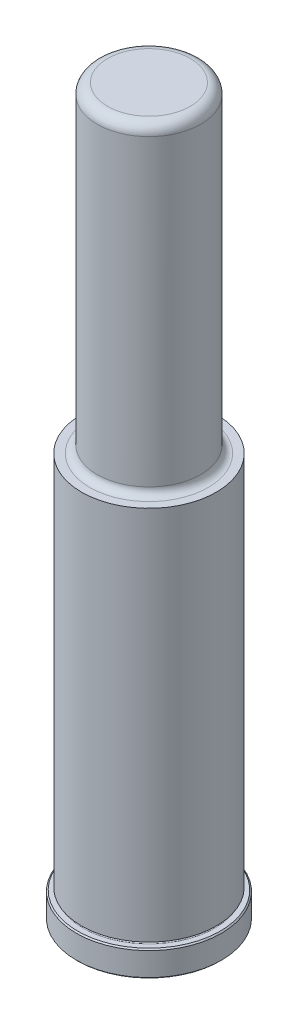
ISO-10303-21;
HEADER;
FILE_DESCRIPTION(('STEP AP214'),'2;1');
FILE_NAME('part.step','',(''),(''),'','','');
FILE_SCHEMA(('AUTOMOTIVE_DESIGN { 1 0 10303 214 1 1 1 1 }'));
ENDSEC;
DATA;
#1=APPLICATION_CONTEXT('core data for automotive mechanical design processes');
#2=APPLICATION_PROTOCOL_DEFINITION('international standard','automotive_design',2000,#1);
#3=PRODUCT_CONTEXT('',#1,'mechanical');
#4=PRODUCT('Part','Part','',(#3));
#5=PRODUCT_RELATED_PRODUCT_CATEGORY('part','',(#4));
#6=PRODUCT_DEFINITION_FORMATION('','',#4);
#7=PRODUCT_DEFINITION_CONTEXT('part definition',#1,'design');
#8=PRODUCT_DEFINITION('design','',#6,#7);
#9=PRODUCT_DEFINITION_SHAPE('','',#8);
#10=(LENGTH_UNIT() NAMED_UNIT(*) SI_UNIT(.MILLI.,.METRE.));
#11=(NAMED_UNIT(*) PLANE_ANGLE_UNIT() SI_UNIT($,.RADIAN.));
#12=(NAMED_UNIT(*) SI_UNIT($,.STERADIAN.) SOLID_ANGLE_UNIT());
#13=UNCERTAINTY_MEASURE_WITH_UNIT(LENGTH_MEASURE(1.E-05),#10,'distance_accuracy_value','');
#14=(GEOMETRIC_REPRESENTATION_CONTEXT(3) GLOBAL_UNCERTAINTY_ASSIGNED_CONTEXT((#13)) GLOBAL_UNIT_ASSIGNED_CONTEXT((#10,
#11,#12)) REPRESENTATION_CONTEXT('',''));
#15=CARTESIAN_POINT('',(0.,0.,0.));
#16=DIRECTION('',(0.,0.,1.));
#17=DIRECTION('',(1.,0.,0.));
#18=AXIS2_PLACEMENT_3D('',#15,#16,#17);
#19=CARTESIAN_POINT('',(0.,0.,0.));
#20=DIRECTION('',(0.,1.,0.));
#21=DIRECTION('',(0.,0.,1.));
#22=AXIS2_PLACEMENT_3D('',#19,#20,#21);
#23=PLANE('',#22);
#24=CARTESIAN_POINT('',(0.,0.,0.));
#25=DIRECTION('',(0.,1.,0.));
#26=DIRECTION('',(0.,0.,1.));
#27=AXIS2_PLACEMENT_3D('',#24,#25,#26);
#28=CIRCLE('',#27,21.844);
#29=CARTESIAN_POINT('',(0.,0.,21.844));
#30=VERTEX_POINT('',#29);
#31=EDGE_CURVE('E46',#30,#30,#28,.F.);
#32=ORIENTED_EDGE('',*,*,#31,.T.);
#33=EDGE_LOOP('',(#32));
#34=FACE_BOUND('',#33,.T.);
#35=ADVANCED_FACE('F31',(#34),#23,.F.);
#36=CARTESIAN_POINT('',(0.,0.,0.));
#37=DIRECTION('',(0.,1.,0.));
#38=DIRECTION('',(0.,0.,1.));
#39=AXIS2_PLACEMENT_3D('',#36,#37,#38);
#40=CYLINDRICAL_SURFACE('',#39,22.225);
#41=CARTESIAN_POINT('',(0.,0.380999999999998,0.));
#42=DIRECTION('',(0.,1.,0.));
#43=DIRECTION('',(0.,0.,1.));
#44=AXIS2_PLACEMENT_3D('',#41,#42,#43);
#45=CIRCLE('',#44,22.225);
#46=CARTESIAN_POINT('',(0.,0.380999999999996,22.225));
#47=VERTEX_POINT('',#46);
#48=EDGE_CURVE('E51',#47,#47,#45,.T.);
#49=CARTESIAN_POINT('',(0.,7.54379999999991,0.));
#50=DIRECTION('',(0.,-1.,0.));
#51=DIRECTION('',(0.,0.,-1.));
#52=AXIS2_PLACEMENT_3D('',#49,#50,#51);
#53=CIRCLE('',#52,22.225);
#54=CARTESIAN_POINT('',(0.,7.54379999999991,22.225));
#55=VERTEX_POINT('',#54);
#56=EDGE_CURVE('E54',#55,#55,#53,.T.);
#57=CARTESIAN_POINT('',(0.,0.380999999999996,22.225));
#58=CARTESIAN_POINT('',(0.,0.455612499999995,22.225));
#59=CARTESIAN_POINT('',(0.,0.530224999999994,22.225));
#60=CARTESIAN_POINT('',(0.,0.679449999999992,22.225));
#61=CARTESIAN_POINT('',(0.,0.754062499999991,22.225));
#62=CARTESIAN_POINT('',(0.,0.903287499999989,22.225));
#63=CARTESIAN_POINT('',(0.,0.977899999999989,22.225));
#64=CARTESIAN_POINT('',(0.,1.12712499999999,22.225));
#65=CARTESIAN_POINT('',(0.,1.20173749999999,22.225));
#66=CARTESIAN_POINT('',(0.,1.35096249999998,22.225));
#67=CARTESIAN_POINT('',(0.,1.42557499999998,22.225));
#68=CARTESIAN_POINT('',(0.,1.57479999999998,22.225));
#69=CARTESIAN_POINT('',(0.,1.64941249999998,22.225));
#70=CARTESIAN_POINT('',(0.,1.79863749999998,22.225));
#71=CARTESIAN_POINT('',(0.,1.87324999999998,22.225));
#72=CARTESIAN_POINT('',(0.,2.02247499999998,22.225));
#73=CARTESIAN_POINT('',(0.,2.09708749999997,22.225));
#74=CARTESIAN_POINT('',(0.,2.24631249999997,22.225));
#75=CARTESIAN_POINT('',(0.,2.32092499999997,22.225));
#76=CARTESIAN_POINT('',(0.,2.47014999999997,22.225));
#77=CARTESIAN_POINT('',(0.,2.54476249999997,22.225));
#78=CARTESIAN_POINT('',(0.,2.69398749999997,22.225));
#79=CARTESIAN_POINT('',(0.,2.76859999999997,22.225));
#80=CARTESIAN_POINT('',(0.,2.91782499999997,22.225));
#81=CARTESIAN_POINT('',(0.,2.99243749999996,22.225));
#82=CARTESIAN_POINT('',(0.,3.14166249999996,22.225));
#83=CARTESIAN_POINT('',(0.,3.21627499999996,22.225));
#84=CARTESIAN_POINT('',(0.,3.36549999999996,22.225));
#85=CARTESIAN_POINT('',(0.,3.44011249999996,22.225));
#86=CARTESIAN_POINT('',(0.,3.58933749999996,22.225));
#87=CARTESIAN_POINT('',(0.,3.66394999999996,22.225));
#88=CARTESIAN_POINT('',(0.,3.81317499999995,22.225));
#89=CARTESIAN_POINT('',(0.,3.88778749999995,22.225));
#90=CARTESIAN_POINT('',(0.,4.03701249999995,22.225));
#91=CARTESIAN_POINT('',(0.,4.11162499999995,22.225));
#92=CARTESIAN_POINT('',(0.,4.26084999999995,22.225));
#93=CARTESIAN_POINT('',(0.,4.33546249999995,22.225));
#94=CARTESIAN_POINT('',(0.,4.48468749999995,22.225));
#95=CARTESIAN_POINT('',(0.,4.55929999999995,22.225));
#96=CARTESIAN_POINT('',(0.,4.70852499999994,22.225));
#97=CARTESIAN_POINT('',(0.,4.78313749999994,22.225));
#98=CARTESIAN_POINT('',(0.,4.93236249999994,22.225));
#99=CARTESIAN_POINT('',(0.,5.00697499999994,22.225));
#100=CARTESIAN_POINT('',(0.,5.15619999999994,22.225));
#101=CARTESIAN_POINT('',(0.,5.23081249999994,22.225));
#102=CARTESIAN_POINT('',(0.,5.38003749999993,22.225));
#103=CARTESIAN_POINT('',(0.,5.45464999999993,22.225));
#104=CARTESIAN_POINT('',(0.,5.60387499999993,22.225));
#105=CARTESIAN_POINT('',(0.,5.67848749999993,22.225));
#106=CARTESIAN_POINT('',(0.,5.82771249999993,22.225));
#107=CARTESIAN_POINT('',(0.,5.90232499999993,22.225));
#108=CARTESIAN_POINT('',(0.,6.05154999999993,22.225));
#109=CARTESIAN_POINT('',(0.,6.12616249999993,22.225));
#110=CARTESIAN_POINT('',(0.,6.27538749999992,22.225));
#111=CARTESIAN_POINT('',(0.,6.34999999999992,22.225));
#112=CARTESIAN_POINT('',(0.,6.49922499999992,22.225));
#113=CARTESIAN_POINT('',(0.,6.57383749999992,22.225));
#114=CARTESIAN_POINT('',(0.,6.72306249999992,22.225));
#115=CARTESIAN_POINT('',(0.,6.79767499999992,22.225));
#116=CARTESIAN_POINT('',(0.,6.94689999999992,22.225));
#117=CARTESIAN_POINT('',(0.,7.02151249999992,22.225));
#118=CARTESIAN_POINT('',(0.,7.17073749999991,22.225));
#119=CARTESIAN_POINT('',(0.,7.24534999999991,22.225));
#120=CARTESIAN_POINT('',(0.,7.39457499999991,22.225));
#121=CARTESIAN_POINT('',(0.,7.46918749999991,22.225));
#122=CARTESIAN_POINT('',(0.,7.54379999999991,22.225));
#123=B_SPLINE_CURVE_WITH_KNOTS('',3,(#57,#58,#59,#60,#61,#62,#63,#64,#65,#66,#67,#68,#69,#70,
#71,#72,#73,#74,#75,#76,#77,#78,#79,#80,#81,#82,#83,#84,#85,#86,#87,#88,#89,#90,#91,#92,#93,#94,
#95,#96,#97,#98,#99,#100,#101,#102,#103,#104,#105,#106,#107,#108,#109,#110,#111,#112,#113,#114,
#115,#116,#117,#118,#119,#120,#121,#122),.UNSPECIFIED.,.F.,.F.,(4,2,2,2,2,2,2,2,2,2,2,2,2,2,2,2,
2,2,2,2,2,2,2,2,2,2,2,2,2,2,2,2,4),(0.,0.223837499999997,0.447674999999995,0.671512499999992,
0.895349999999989,1.11918749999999,1.34302499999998,1.56686249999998,1.79069999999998,
2.01453749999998,2.23837499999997,2.46221249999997,2.68604999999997,2.90988749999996,
3.13372499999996,3.35756249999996,3.58139999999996,3.80523749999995,4.02907499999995,
4.25291249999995,4.47674999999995,4.70058749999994,4.92442499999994,5.14826249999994,
5.37209999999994,5.59593749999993,5.81977499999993,6.04361249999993,6.26744999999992,
6.49128749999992,6.71512499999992,6.93896249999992,7.16279999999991),.UNSPECIFIED.);
#124=EDGE_CURVE('BSEAM110',#47,#55,#123,.T.);
#125=ORIENTED_EDGE('',*,*,#48,.T.);
#126=ORIENTED_EDGE('',*,*,#56,.T.);
#127=ORIENTED_EDGE('',*,*,#124,.T.);
#128=ORIENTED_EDGE('',*,*,#124,.F.);
#129=EDGE_LOOP('',(#125,#127,#126,#128));
#130=FACE_BOUND('',#129,.T.);
#131=ADVANCED_FACE('F110',(#130),#40,.T.);
#132=CARTESIAN_POINT('',(0.,7.9248,-22.225));
#133=DIRECTION('',(0.,-1.,0.));
#134=DIRECTION('',(0.,0.,-1.));
#135=AXIS2_PLACEMENT_3D('',#132,#133,#134);
#136=PLANE('',#135);
#137=CARTESIAN_POINT('',(0.,7.9248,0.));
#138=DIRECTION('',(0.,-1.,0.));
#139=DIRECTION('',(0.,0.,-1.));
#140=AXIS2_PLACEMENT_3D('',#137,#138,#139);
#141=CIRCLE('',#140,21.8439999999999);
#142=CARTESIAN_POINT('',(0.,7.9248,-21.8439999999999));
#143=VERTEX_POINT('',#142);
#144=EDGE_CURVE('E42',#143,#143,#141,.F.);
#145=ORIENTED_EDGE('',*,*,#144,.T.);
#146=EDGE_LOOP('',(#145));
#147=FACE_BOUND('',#146,.T.);
#148=CARTESIAN_POINT('',(0.,7.9248,0.));
#149=DIRECTION('',(0.,1.,0.));
#150=DIRECTION('',(0.,0.,1.));
#151=AXIS2_PLACEMENT_3D('',#148,#149,#150);
#152=CIRCLE('',#151,20.2438);
#153=CARTESIAN_POINT('',(0.,7.92479999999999,20.2438));
#154=VERTEX_POINT('',#153);
#155=EDGE_CURVE('E57',#154,#154,#152,.T.);
#156=ORIENTED_EDGE('',*,*,#155,.F.);
#157=EDGE_LOOP('',(#156));
#158=FACE_BOUND('',#157,.T.);
#159=ADVANCED_FACE('F105',(#147,#158),#136,.F.);
#160=CARTESIAN_POINT('',(0.,8.3058,0.));
#161=DIRECTION('',(0.,1.,0.));
#162=DIRECTION('',(0.,0.,1.));
#163=AXIS2_PLACEMENT_3D('',#160,#161,#162);
#164=TOROIDAL_SURFACE('',#163,20.2438,0.380999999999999);
#165=CARTESIAN_POINT('',(0.,8.6868,0.));
#166=DIRECTION('',(0.,1.,0.));
#167=DIRECTION('',(0.,0.,1.));
#168=AXIS2_PLACEMENT_3D('',#165,#166,#167);
#169=CIRCLE('',#168,20.2438);
#170=CARTESIAN_POINT('',(0.,8.68679999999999,20.2438));
#171=VERTEX_POINT('',#170);
#172=EDGE_CURVE('E60',#171,#171,#169,.T.);
#173=ORIENTED_EDGE('',*,*,#172,.F.);
#174=EDGE_LOOP('',(#173));
#175=FACE_BOUND('',#174,.T.);
#176=ORIENTED_EDGE('',*,*,#155,.T.);
#177=EDGE_LOOP('',(#176));
#178=FACE_BOUND('',#177,.T.);
#179=ADVANCED_FACE('F99',(#175,#178),#164,.F.);
#180=CARTESIAN_POINT('',(0.,8.6868,-20.2438));
#181=DIRECTION('',(0.,1.,0.));
#182=DIRECTION('',(0.,0.,1.));
#183=AXIS2_PLACEMENT_3D('',#180,#181,#182);
#184=PLANE('',#183);
#185=CARTESIAN_POINT('',(0.,8.6868,0.));
#186=DIRECTION('',(0.,1.,0.));
#187=DIRECTION('',(0.,0.,1.));
#188=AXIS2_PLACEMENT_3D('',#185,#186,#187);
#189=CIRCLE('',#188,20.6502);
#190=CARTESIAN_POINT('',(0.,8.6868,20.6502));
#191=VERTEX_POINT('',#190);
#192=EDGE_CURVE('E63',#191,#191,#189,.T.);
#193=ORIENTED_EDGE('',*,*,#192,.F.);
#194=EDGE_LOOP('',(#193));
#195=FACE_BOUND('',#194,.T.);
#196=ORIENTED_EDGE('',*,*,#172,.T.);
#197=EDGE_LOOP('',(#196));
#198=FACE_BOUND('',#197,.T.);
#199=ADVANCED_FACE('F93',(#195,#198),#184,.F.);
#200=CARTESIAN_POINT('',(0.,0.,0.));
#201=DIRECTION('',(0.,1.,0.));
#202=DIRECTION('',(0.,0.,1.));
#203=AXIS2_PLACEMENT_3D('',#200,#201,#202);
#204=CYLINDRICAL_SURFACE('',#203,20.6502);
#205=CARTESIAN_POINT('',(0.,123.825,0.));
#206=DIRECTION('',(0.,1.,0.));
#207=DIRECTION('',(0.,0.,1.));
#208=AXIS2_PLACEMENT_3D('',#205,#206,#207);
#209=CIRCLE('',#208,20.6502);
#210=CARTESIAN_POINT('',(0.,123.825,20.6502));
#211=VERTEX_POINT('',#210);
#212=EDGE_CURVE('E66',#211,#211,#209,.T.);
#213=ORIENTED_EDGE('',*,*,#212,.F.);
#214=EDGE_LOOP('',(#213));
#215=FACE_BOUND('',#214,.T.);
#216=ORIENTED_EDGE('',*,*,#192,.T.);
#217=EDGE_LOOP('',(#216));
#218=FACE_BOUND('',#217,.T.);
#219=ADVANCED_FACE('F87',(#215,#218),#204,.T.);
#220=CARTESIAN_POINT('',(0.,123.825,-20.6502));
#221=DIRECTION('',(0.,-1.,0.));
#222=DIRECTION('',(0.,0.,-1.));
#223=AXIS2_PLACEMENT_3D('',#220,#221,#222);
#224=PLANE('',#223);
#225=CARTESIAN_POINT('',(0.,123.825,0.));
#226=DIRECTION('',(0.,1.,0.));
#227=DIRECTION('',(0.,0.,1.));
#228=AXIS2_PLACEMENT_3D('',#225,#226,#227);
#229=CIRCLE('',#228,18.1483);
#230=CARTESIAN_POINT('',(0.,123.825,18.1483));
#231=VERTEX_POINT('',#230);
#232=EDGE_CURVE('E69',#231,#231,#229,.T.);
#233=ORIENTED_EDGE('',*,*,#232,.F.);
#234=EDGE_LOOP('',(#233));
#235=FACE_BOUND('',#234,.T.);
#236=ORIENTED_EDGE('',*,*,#212,.T.);
#237=EDGE_LOOP('',(#236));
#238=FACE_BOUND('',#237,.T.);
#239=ADVANCED_FACE('F81',(#235,#238),#224,.F.);
#240=CARTESIAN_POINT('',(0.,126.111,0.));
#241=DIRECTION('',(0.,1.,0.));
#242=DIRECTION('',(0.,0.,1.));
#243=AXIS2_PLACEMENT_3D('',#240,#241,#242);
#244=TOROIDAL_SURFACE('',#243,18.1483,2.28600000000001);
#245=CARTESIAN_POINT('',(0.,126.111,0.));
#246=DIRECTION('',(0.,1.,0.));
#247=DIRECTION('',(0.,0.,1.));
#248=AXIS2_PLACEMENT_3D('',#245,#246,#247);
#249=CIRCLE('',#248,15.8623);
#250=CARTESIAN_POINT('',(0.,126.111,15.8623));
#251=VERTEX_POINT('',#250);
#252=EDGE_CURVE('E72',#251,#251,#249,.T.);
#253=ORIENTED_EDGE('',*,*,#252,.F.);
#254=EDGE_LOOP('',(#253));
#255=FACE_BOUND('',#254,.T.);
#256=ORIENTED_EDGE('',*,*,#232,.T.);
#257=EDGE_LOOP('',(#256));
#258=FACE_BOUND('',#257,.T.);
#259=ADVANCED_FACE('F78',(#255,#258),#244,.F.);
#260=CARTESIAN_POINT('',(0.,0.,0.));
#261=DIRECTION('',(0.,1.,0.));
#262=DIRECTION('',(0.,0.,1.));
#263=AXIS2_PLACEMENT_3D('',#260,#261,#262);
#264=CYLINDRICAL_SURFACE('',#263,15.8623);
#265=CARTESIAN_POINT('',(0.,219.075,0.));
#266=DIRECTION('',(0.,-1.,0.));
#267=DIRECTION('',(0.,0.,-1.));
#268=AXIS2_PLACEMENT_3D('',#265,#266,#267);
#269=CIRCLE('',#268,15.8623);
#270=CARTESIAN_POINT('',(0.,219.075,-15.8623));
#271=VERTEX_POINT('',#270);
#272=EDGE_CURVE('E10',#271,#271,#269,.T.);
#273=ORIENTED_EDGE('',*,*,#272,.T.);
#274=EDGE_LOOP('',(#273));
#275=FACE_BOUND('',#274,.T.);
#276=ORIENTED_EDGE('',*,*,#252,.T.);
#277=EDGE_LOOP('',(#276));
#278=FACE_BOUND('',#277,.T.);
#279=ADVANCED_FACE('F76',(#275,#278),#264,.T.);
#280=CARTESIAN_POINT('',(0.,222.25,-15.8623));
#281=DIRECTION('',(0.,-1.,0.));
#282=DIRECTION('',(0.,0.,-1.));
#283=AXIS2_PLACEMENT_3D('',#280,#281,#282);
#284=PLANE('',#283);
#285=CARTESIAN_POINT('',(0.,222.25,0.));
#286=DIRECTION('',(0.,-1.,0.));
#287=DIRECTION('',(0.,0.,-1.));
#288=AXIS2_PLACEMENT_3D('',#285,#286,#287);
#289=CIRCLE('',#288,12.6873);
#290=CARTESIAN_POINT('',(0.,222.25,-12.6873));
#291=VERTEX_POINT('',#290);
#292=EDGE_CURVE('E38',#291,#291,#289,.F.);
#293=ORIENTED_EDGE('',*,*,#292,.T.);
#294=EDGE_LOOP('',(#293));
#295=FACE_BOUND('',#294,.T.);
#296=ADVANCED_FACE('F127',(#295),#284,.F.);
#297=CARTESIAN_POINT('',(0.,0.380999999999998,0.));
#298=DIRECTION('',(0.,1.,0.));
#299=DIRECTION('',(0.,0.,1.));
#300=AXIS2_PLACEMENT_3D('',#297,#298,#299);
#301=CONICAL_SURFACE('',#300,22.225,0.785398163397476);
#302=CARTESIAN_POINT('',(0.,0.,21.844));
#303=CARTESIAN_POINT('',(0.,0.00396874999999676,21.84796875));
#304=CARTESIAN_POINT('',(0.,0.00793749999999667,21.8519375));
#305=CARTESIAN_POINT('',(0.,0.0158749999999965,21.859875));
#306=CARTESIAN_POINT('',(0.,0.0198437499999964,21.86384375));
#307=CARTESIAN_POINT('',(0.,0.0277812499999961,21.87178125));
#308=CARTESIAN_POINT('',(0.,0.031749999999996,21.87575));
#309=CARTESIAN_POINT('',(0.,0.039687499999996,21.8836875));
#310=CARTESIAN_POINT('',(0.,0.0436562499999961,21.88765625));
#311=CARTESIAN_POINT('',(0.,0.0515937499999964,21.89559375));
#312=CARTESIAN_POINT('',(0.,0.0555624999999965,21.8995625));
#313=CARTESIAN_POINT('',(0.,0.0634999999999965,21.9075));
#314=CARTESIAN_POINT('',(0.,0.0674687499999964,21.91146875));
#315=CARTESIAN_POINT('',(0.,0.0754062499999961,21.91940625));
#316=CARTESIAN_POINT('',(0.,0.0793749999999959,21.923375));
#317=CARTESIAN_POINT('',(0.,0.0873124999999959,21.9313125));
#318=CARTESIAN_POINT('',(0.,0.091281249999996,21.93528125));
#319=CARTESIAN_POINT('',(0.,0.0992187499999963,21.94321875));
#320=CARTESIAN_POINT('',(0.,0.103187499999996,21.9471875));
#321=CARTESIAN_POINT('',(0.,0.111124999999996,21.955125));
#322=CARTESIAN_POINT('',(0.,0.115093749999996,21.95909375));
#323=CARTESIAN_POINT('',(0.,0.123031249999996,21.96703125));
#324=CARTESIAN_POINT('',(0.,0.126999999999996,21.971));
#325=CARTESIAN_POINT('',(0.,0.134937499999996,21.9789375));
#326=CARTESIAN_POINT('',(0.,0.138906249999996,21.98290625));
#327=CARTESIAN_POINT('',(0.,0.146843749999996,21.99084375));
#328=CARTESIAN_POINT('',(0.,0.150812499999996,21.9948125));
#329=CARTESIAN_POINT('',(0.,0.158749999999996,22.00275));
#330=CARTESIAN_POINT('',(0.,0.162718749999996,22.00671875));
#331=CARTESIAN_POINT('',(0.,0.170656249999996,22.01465625));
#332=CARTESIAN_POINT('',(0.,0.174624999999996,22.018625));
#333=CARTESIAN_POINT('',(0.,0.182562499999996,22.0265625));
#334=CARTESIAN_POINT('',(0.,0.186531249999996,22.03053125));
#335=CARTESIAN_POINT('',(0.,0.194468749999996,22.03846875));
#336=CARTESIAN_POINT('',(0.,0.198437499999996,22.0424375));
#337=CARTESIAN_POINT('',(0.,0.206374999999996,22.050375));
#338=CARTESIAN_POINT('',(0.,0.210343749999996,22.05434375));
#339=CARTESIAN_POINT('',(0.,0.218281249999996,22.06228125));
#340=CARTESIAN_POINT('',(0.,0.222249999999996,22.06625));
#341=CARTESIAN_POINT('',(0.,0.230187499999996,22.0741875));
#342=CARTESIAN_POINT('',(0.,0.234156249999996,22.07815625));
#343=CARTESIAN_POINT('',(0.,0.242093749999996,22.08609375));
#344=CARTESIAN_POINT('',(0.,0.246062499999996,22.0900625));
#345=CARTESIAN_POINT('',(0.,0.253999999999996,22.098));
#346=CARTESIAN_POINT('',(0.,0.257968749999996,22.10196875));
#347=CARTESIAN_POINT('',(0.,0.265906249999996,22.10990625));
#348=CARTESIAN_POINT('',(0.,0.269874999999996,22.113875));
#349=CARTESIAN_POINT('',(0.,0.277812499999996,22.1218125));
#350=CARTESIAN_POINT('',(0.,0.281781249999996,22.12578125));
#351=CARTESIAN_POINT('',(0.,0.289718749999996,22.13371875));
#352=CARTESIAN_POINT('',(0.,0.293687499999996,22.1376875));
#353=CARTESIAN_POINT('',(0.,0.301624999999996,22.145625));
#354=CARTESIAN_POINT('',(0.,0.305593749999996,22.14959375));
#355=CARTESIAN_POINT('',(0.,0.313531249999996,22.15753125));
#356=CARTESIAN_POINT('',(0.,0.317499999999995,22.1615));
#357=CARTESIAN_POINT('',(0.,0.325437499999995,22.1694375));
#358=CARTESIAN_POINT('',(0.,0.329406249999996,22.17340625));
#359=CARTESIAN_POINT('',(0.,0.337343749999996,22.18134375));
#360=CARTESIAN_POINT('',(0.,0.341312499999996,22.1853125));
#361=CARTESIAN_POINT('',(0.,0.349249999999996,22.19325));
#362=CARTESIAN_POINT('',(0.,0.353218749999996,22.19721875));
#363=CARTESIAN_POINT('',(0.,0.361156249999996,22.20515625));
#364=CARTESIAN_POINT('',(0.,0.365124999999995,22.209125));
#365=CARTESIAN_POINT('',(0.,0.373062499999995,22.2170625));
#366=CARTESIAN_POINT('',(0.,0.377031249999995,22.22103125));
#367=CARTESIAN_POINT('',(0.,0.380999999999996,22.225));
#368=B_SPLINE_CURVE_WITH_KNOTS('',3,(#302,#303,#304,#305,#306,#307,#308,#309,#310,#311,#312,
#313,#314,#315,#316,#317,#318,#319,#320,#321,#322,#323,#324,#325,#326,#327,#328,#329,#330,#331,
#332,#333,#334,#335,#336,#337,#338,#339,#340,#341,#342,#343,#344,#345,#346,#347,#348,#349,#350,
#351,#352,#353,#354,#355,#356,#357,#358,#359,#360,#361,#362,#363,#364,#365,#366,#367),
.UNSPECIFIED.,.F.,.F.,(4,2,2,2,2,2,2,2,2,2,2,2,2,2,2,2,2,2,2,2,2,2,2,2,2,2,2,2,2,2,2,2,4),(0.,
0.0168379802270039,0.0336759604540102,0.0505139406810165,0.0673519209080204,0.0841899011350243,
0.101027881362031,0.117865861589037,0.134703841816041,0.151541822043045,0.168379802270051,
0.185217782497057,0.202055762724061,0.218893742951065,0.235731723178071,0.252569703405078,
0.269407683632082,0.286245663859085,0.303083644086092,0.319921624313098,0.336759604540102,
0.353597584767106,0.370435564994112,0.387273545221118,0.404111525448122,0.420949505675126,
0.437787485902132,0.454625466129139,0.471463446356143,0.488301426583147,0.505139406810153,
0.521977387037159,0.538815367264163),.UNSPECIFIED.);
#369=EDGE_CURVE('BSEAM124',#30,#47,#368,.T.);
#370=ORIENTED_EDGE('',*,*,#31,.F.);
#371=ORIENTED_EDGE('',*,*,#48,.F.);
#372=ORIENTED_EDGE('',*,*,#369,.T.);
#373=ORIENTED_EDGE('',*,*,#369,.F.);
#374=EDGE_LOOP('',(#370,#372,#371,#373));
#375=FACE_BOUND('',#374,.T.);
#376=ADVANCED_FACE('F124',(#375),#301,.T.);
#377=CARTESIAN_POINT('',(0.,7.9248,0.));
#378=DIRECTION('',(0.,-1.,0.));
#379=DIRECTION('',(0.,0.,-1.));
#380=AXIS2_PLACEMENT_3D('',#377,#378,#379);
#381=CONICAL_SURFACE('',#380,21.8439999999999,0.785398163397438);
#382=ORIENTED_EDGE('',*,*,#56,.F.);
#383=EDGE_LOOP('',(#382));
#384=FACE_BOUND('',#383,.T.);
#385=ORIENTED_EDGE('',*,*,#144,.F.);
#386=EDGE_LOOP('',(#385));
#387=FACE_BOUND('',#386,.T.);
#388=ADVANCED_FACE('F126',(#384,#387),#381,.T.);
#389=CARTESIAN_POINT('',(0.,219.075,0.));
#390=DIRECTION('',(0.,-1.,0.));
#391=DIRECTION('',(0.,0.,-1.));
#392=AXIS2_PLACEMENT_3D('',#389,#390,#391);
#393=TOROIDAL_SURFACE('',#392,12.6873,3.175);
#394=ORIENTED_EDGE('',*,*,#272,.F.);
#395=EDGE_LOOP('',(#394));
#396=FACE_BOUND('',#395,.T.);
#397=ORIENTED_EDGE('',*,*,#292,.F.);
#398=EDGE_LOOP('',(#397));
#399=FACE_BOUND('',#398,.T.);
#400=ADVANCED_FACE('F33',(#396,#399),#393,.T.);
#401=CLOSED_SHELL('',(#35,#131,#159,#179,#199,#219,#239,#259,#279,#296,#376,#388,#400));
#402=MANIFOLD_SOLID_BREP('B2',#401);
#403=ADVANCED_BREP_SHAPE_REPRESENTATION('',(#18,#402),#14);
#404=SHAPE_DEFINITION_REPRESENTATION(#9,#403);
ENDSEC;
END-ISO-10303-21;
